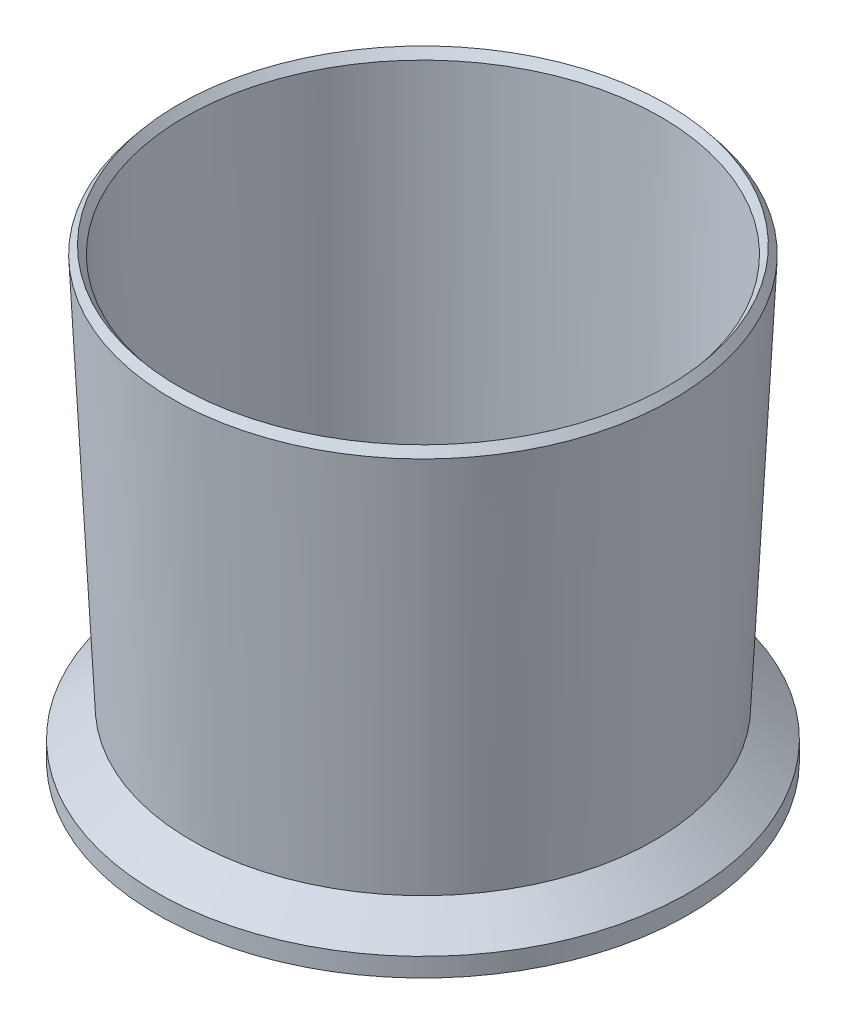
from build123d import *

# Parameters (mm, degrees)
SKETCH2_R                = 6.5
SIX_DRAINAGE_HOLES_DEPTH = 373.86056375


with BuildPart() as part:
    # Sketch1 → Planter Body _ Central Socket (revolve)
    with BuildSketch(Plane.XY, mode=Mode.PRIVATE) as planter_body_central_socket_sk:
        Polygon((0, 0), (130, 0), (130, 10), (162, 10), (162, 0), (170, 0), (170, 12), (148, 30), (160, 280), (156, 285), (152, 280), (143, 18), (100, 18), (30, 80), (30, 100), (13.5, 100), (13.5, 8), (0, 8), align=None)
    revolve(planter_body_central_socket_sk.sketch.rotate(Axis((0, -10, 0), (0, 1, 0)), 90), axis=Axis((0, -10, 0), (0, 1, 0)))

    # Sketch2 → Six Drainage Holes (cut, through all)
    with BuildSketch(Plane(origin=(0, 0, 0), x_dir=(1, 0, 0), z_dir=(0, 1, 0))):
        with Locations(Location((118, 0, 0), (0, 0, 270))):
            Circle(SKETCH2_R)
        with Locations(Location((59, 102.190997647, 0), (0, 0, 270))):
            Circle(SKETCH2_R)
        with Locations(Location((-59, 102.190997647, 0), (0, 0, 270))):
            Circle(SKETCH2_R)
        with Locations(Location((-118, 0, 0), (0, 0, 270))):
            Circle(SKETCH2_R)
        with Locations(Location((-59, -102.190997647, 0), (0, 0, 270))):
            Circle(SKETCH2_R)
        with Locations(Location((59, -102.190997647, 0), (0, 0, 270))):
            Circle(SKETCH2_R)
    extrude(amount=SIX_DRAINAGE_HOLES_DEPTH, mode=Mode.SUBTRACT)


solid = part.part
